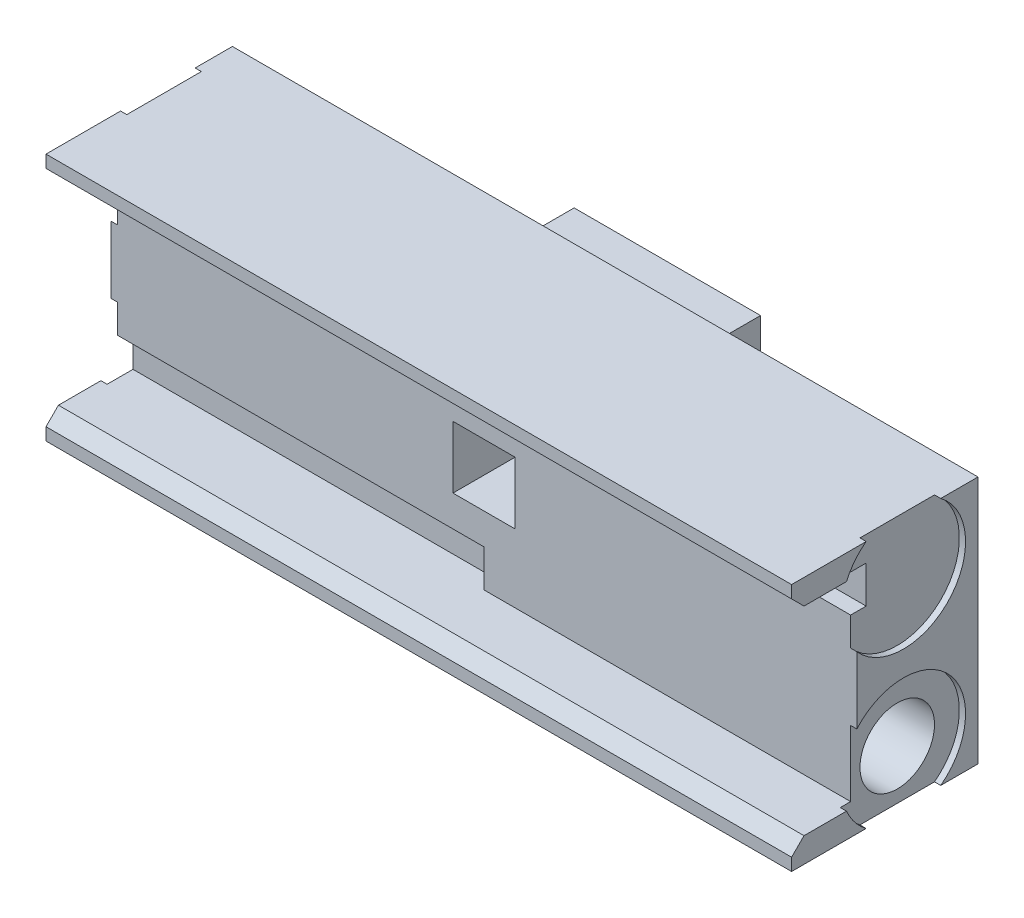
from build123d import *

# Parameters (mm, degrees)
SKETCH1_W           = 120
SKETCH1_H           = 40
BOSS_EXTRUDE1_DEPTH = 30
CUT_EXTRUDE1_DEPTH  = 60
CUT_EXTRUDE2_DEPTH  = 60
SKETCH4_W           = 30
SKETCH4_H           = 30
BOSS_EXTRUDE2_DEPTH = 10
SKETCH5_R           = 10
CUT_EXTRUDE3_DEPTH  = 1
SKETCH7_R           = 6
CUT_EXTRUDE5_DEPTH  = 55
SKETCH6_W           = 10
SKETCH6_H           = 10
CUT_EXTRUDE4_DEPTH  = 10
CHAMFER1_SIZE       = 2
SKETCH8_R           = 6
CUT_EXTRUDE6_DEPTH  = 55


with BuildPart() as part:
    # Sketch1 → Boss-Extrude1 (new body)
    with BuildSketch(Plane.XY):
        Rectangle(SKETCH1_W, SKETCH1_H)
    extrude(amount=BOSS_EXTRUDE1_DEPTH)

    # Sketch2 → Cut-Extrude1 (cut)
    with BuildSketch(Plane(origin=(60, 0, 0), x_dir=(0, 0, -1), z_dir=(1, 0, 0))):
        Polygon((-30, 16), (-19.782067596, 16), (-17, 16), (-17, 10), (-19.5, 10), (-19.5, -16), (-30, -16), align=None)
    extrude(amount=-CUT_EXTRUDE1_DEPTH, mode=Mode.SUBTRACT)

    # Sketch3 → Cut-Extrude2 (cut)
    with BuildSketch(Plane.ZY.offset(60)):
        Polygon((30, 16), (19.5, 16), (19.5, -10), (17, -10), (17, -16), (18.436994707, -16), (30, -16), align=None)
    extrude(amount=-CUT_EXTRUDE2_DEPTH, mode=Mode.SUBTRACT)

    # Sketch4 → Boss-Extrude2 (add)
    with BuildSketch(Plane(origin=(0, 0, 0), x_dir=(-1, 0, 0), z_dir=(0, 0, -1))):
        Rectangle(SKETCH4_W, SKETCH4_H)
    extrude(amount=BOSS_EXTRUDE2_DEPTH)

    # Sketch5 → Cut-Extrude3 (cut)
    with BuildSketch(Plane(origin=(60, 0, 0), x_dir=(0, 0, -1), z_dir=(1, 0, 0))):
        with Locations((-12, 12)):
            Circle(SKETCH5_R)
        with Locations((-12, -12)):
            Circle(SKETCH5_R)
    cut_extrude3 = extrude(amount=-CUT_EXTRUDE3_DEPTH, mode=Mode.SUBTRACT)

    # Sketch7 → Cut-Extrude5 (cut)
    with BuildSketch(Plane(origin=(59, 0, 0), x_dir=(0, 0, -1), z_dir=(1, 0, 0))):
        with Locations((-12, -12)):
            Circle(SKETCH7_R)
    extrude(amount=-CUT_EXTRUDE5_DEPTH, mode=Mode.SUBTRACT)

    # Mirror1: Cut-Extrude3 across plane
    add(cut_extrude3.mirror(Plane(origin=(0, 0, 0), x_dir=(0, 0, 1), z_dir=(1, 0, 0))), mode=Mode.SUBTRACT)

    # Sketch6 → Cut-Extrude4 (cut)
    with BuildSketch(Plane.XY.offset(19.5)):
        Rectangle(SKETCH6_W, SKETCH6_H)
    extrude(amount=-CUT_EXTRUDE4_DEPTH, mode=Mode.SUBTRACT)

    # Chamfer1
    chamfer1_edges = [part.edges().sort_by_distance(p)[0] for p in [
        (0, -16, 30),
        (0, 16, 30),
    ]]
    chamfer(chamfer1_edges, length=CHAMFER1_SIZE)

    # Sketch8 → Cut-Extrude6 (cut)
    with BuildSketch(Plane.ZY.offset(59)):
        with Locations((12, 12)):
            Circle(SKETCH8_R)
    extrude(amount=-CUT_EXTRUDE6_DEPTH, mode=Mode.SUBTRACT)


solid = part.part
